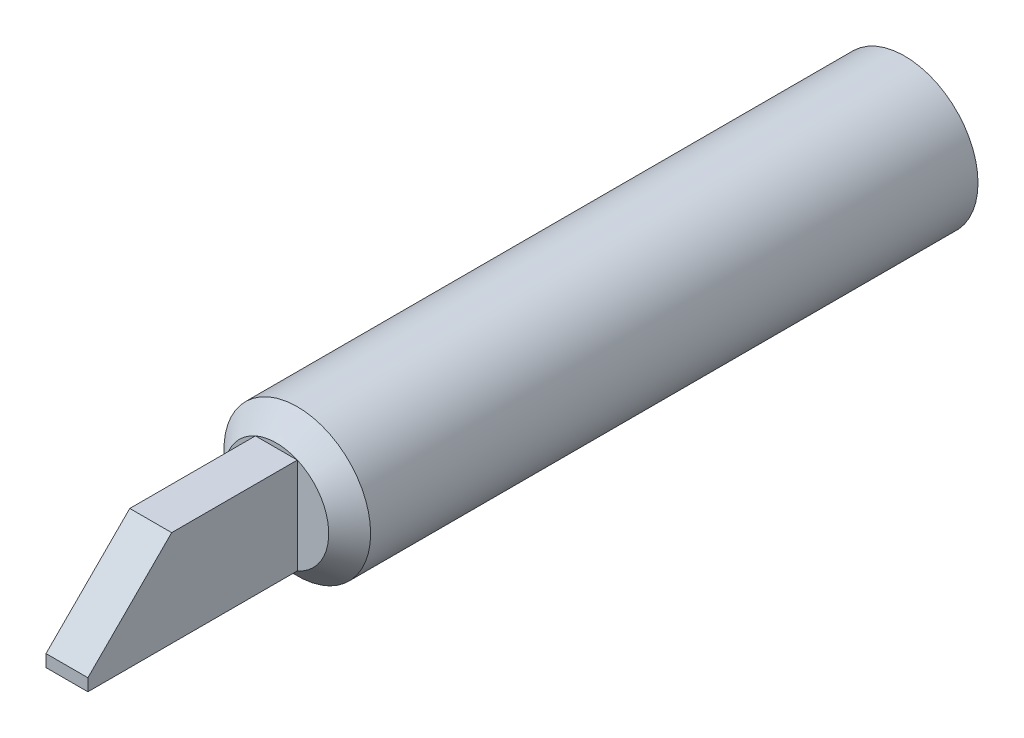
ISO-10303-21;
HEADER;
FILE_DESCRIPTION(('STEP AP214'),'2;1');
FILE_NAME('part.step','',(''),(''),'','','');
FILE_SCHEMA(('AUTOMOTIVE_DESIGN { 1 0 10303 214 1 1 1 1 }'));
ENDSEC;
DATA;
#1=APPLICATION_CONTEXT('core data for automotive mechanical design processes');
#2=APPLICATION_PROTOCOL_DEFINITION('international standard','automotive_design',2000,#1);
#3=PRODUCT_CONTEXT('',#1,'mechanical');
#4=PRODUCT('Part','Part','',(#3));
#5=PRODUCT_RELATED_PRODUCT_CATEGORY('part','',(#4));
#6=PRODUCT_DEFINITION_FORMATION('','',#4);
#7=PRODUCT_DEFINITION_CONTEXT('part definition',#1,'design');
#8=PRODUCT_DEFINITION('design','',#6,#7);
#9=PRODUCT_DEFINITION_SHAPE('','',#8);
#10=(LENGTH_UNIT() NAMED_UNIT(*) SI_UNIT(.MILLI.,.METRE.));
#11=(NAMED_UNIT(*) PLANE_ANGLE_UNIT() SI_UNIT($,.RADIAN.));
#12=(NAMED_UNIT(*) SI_UNIT($,.STERADIAN.) SOLID_ANGLE_UNIT());
#13=UNCERTAINTY_MEASURE_WITH_UNIT(LENGTH_MEASURE(1.E-05),#10,'distance_accuracy_value','');
#14=(GEOMETRIC_REPRESENTATION_CONTEXT(3) GLOBAL_UNCERTAINTY_ASSIGNED_CONTEXT((#13)) GLOBAL_UNIT_ASSIGNED_CONTEXT((#10,
#11,#12)) REPRESENTATION_CONTEXT('',''));
#15=CARTESIAN_POINT('',(0.,0.,0.));
#16=DIRECTION('',(0.,0.,1.));
#17=DIRECTION('',(1.,0.,0.));
#18=AXIS2_PLACEMENT_3D('',#15,#16,#17);
#19=CARTESIAN_POINT('',(0.,0.,30.));
#20=DIRECTION('',(0.,0.,1.));
#21=DIRECTION('',(1.,0.,0.));
#22=AXIS2_PLACEMENT_3D('',#19,#20,#21);
#23=PLANE('',#22);
#24=DIRECTION('',(0.,-1.,0.));
#25=VECTOR('',#24,1.);
#26=CARTESIAN_POINT('',(-1.,2.2912878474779,30.));
#27=LINE('',#26,#25);
#28=CARTESIAN_POINT('',(-1.,2.2912878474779,30.));
#29=VERTEX_POINT('',#28);
#30=CARTESIAN_POINT('',(-1.,-2.2912878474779,30.));
#31=VERTEX_POINT('',#30);
#32=EDGE_CURVE('E100',#29,#31,#27,.T.);
#33=ORIENTED_EDGE('',*,*,#32,.F.);
#34=CARTESIAN_POINT('',(0.,0.,30.));
#35=DIRECTION('',(0.,0.,1.));
#36=DIRECTION('',(1.,0.,0.));
#37=AXIS2_PLACEMENT_3D('',#34,#35,#36);
#38=CIRCLE('',#37,2.49999999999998);
#39=EDGE_CURVE('E114',#29,#31,#38,.T.);
#40=ORIENTED_EDGE('',*,*,#39,.T.);
#41=EDGE_LOOP('',(#33,#40));
#42=FACE_BOUND('',#41,.T.);
#43=ADVANCED_FACE('F32',(#42),#23,.T.);
#44=DIRECTION('',(-1.,0.,0.));
#45=VECTOR('',#44,1.);
#46=CARTESIAN_POINT('',(-1.,2.2912878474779,30.));
#47=LINE('',#46,#45);
#48=CARTESIAN_POINT('',(1.,2.2912878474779,30.));
#49=VERTEX_POINT('',#48);
#50=EDGE_CURVE('E85',#49,#29,#47,.T.);
#51=ORIENTED_EDGE('',*,*,#50,.F.);
#52=EDGE_CURVE('E110',#49,#29,#38,.T.);
#53=ORIENTED_EDGE('',*,*,#52,.T.);
#54=EDGE_LOOP('',(#51,#53));
#55=FACE_BOUND('',#54,.T.);
#56=ADVANCED_FACE('F151',(#55),#23,.T.);
#57=DIRECTION('',(0.,1.,0.));
#58=VECTOR('',#57,1.);
#59=CARTESIAN_POINT('',(1.,2.2912878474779,30.));
#60=LINE('',#59,#58);
#61=CARTESIAN_POINT('',(1.,-2.2912878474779,30.));
#62=VERTEX_POINT('',#61);
#63=EDGE_CURVE('E139',#62,#49,#60,.T.);
#64=ORIENTED_EDGE('',*,*,#63,.F.);
#65=EDGE_CURVE('E104',#62,#49,#38,.T.);
#66=ORIENTED_EDGE('',*,*,#65,.T.);
#67=EDGE_LOOP('',(#64,#66));
#68=FACE_BOUND('',#67,.T.);
#69=ADVANCED_FACE('F152',(#68),#23,.T.);
#70=CARTESIAN_POINT('',(0.,0.,30.));
#71=DIRECTION('',(0.,0.,-1.));
#72=DIRECTION('',(-1.,0.,0.));
#73=AXIS2_PLACEMENT_3D('',#70,#71,#72);
#74=CYLINDRICAL_SURFACE('',#73,3.5);
#75=CARTESIAN_POINT('',(0.,0.,29.));
#76=DIRECTION('',(0.,0.,1.));
#77=DIRECTION('',(1.,0.,0.));
#78=AXIS2_PLACEMENT_3D('',#75,#76,#77);
#79=CIRCLE('',#78,3.5);
#80=CARTESIAN_POINT('',(3.5,0.,29.));
#81=VERTEX_POINT('',#80);
#82=EDGE_CURVE('E113',#81,#81,#79,.F.);
#83=ORIENTED_EDGE('',*,*,#82,.T.);
#84=EDGE_LOOP('',(#83));
#85=FACE_BOUND('',#84,.T.);
#86=CARTESIAN_POINT('',(0.,0.,0.));
#87=DIRECTION('',(0.,0.,1.));
#88=DIRECTION('',(1.,0.,0.));
#89=AXIS2_PLACEMENT_3D('',#86,#87,#88);
#90=CIRCLE('',#89,3.5);
#91=CARTESIAN_POINT('',(3.5,0.,0.));
#92=VERTEX_POINT('',#91);
#93=EDGE_CURVE('E101',#92,#92,#90,.T.);
#94=ORIENTED_EDGE('',*,*,#93,.T.);
#95=EDGE_LOOP('',(#94));
#96=FACE_BOUND('',#95,.T.);
#97=ADVANCED_FACE('F120',(#85,#96),#74,.T.);
#98=DIRECTION('',(1.,0.,0.));
#99=VECTOR('',#98,1.);
#100=CARTESIAN_POINT('',(-1.,-2.2912878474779,30.));
#101=LINE('',#100,#99);
#102=EDGE_CURVE('E143',#31,#62,#101,.T.);
#103=ORIENTED_EDGE('',*,*,#102,.F.);
#104=EDGE_CURVE('E153',#31,#62,#38,.T.);
#105=ORIENTED_EDGE('',*,*,#104,.T.);
#106=EDGE_LOOP('',(#103,#105));
#107=FACE_BOUND('',#106,.T.);
#108=ADVANCED_FACE('F165',(#107),#23,.T.);
#109=CARTESIAN_POINT('',(0.,0.,0.));
#110=DIRECTION('',(0.,0.,1.));
#111=DIRECTION('',(1.,0.,0.));
#112=AXIS2_PLACEMENT_3D('',#109,#110,#111);
#113=PLANE('',#112);
#114=ORIENTED_EDGE('',*,*,#93,.F.);
#115=EDGE_LOOP('',(#114));
#116=FACE_BOUND('',#115,.T.);
#117=ADVANCED_FACE('F126',(#116),#113,.F.);
#118=CARTESIAN_POINT('',(0.,0.,30.));
#119=DIRECTION('',(0.,0.,-1.));
#120=DIRECTION('',(-1.,0.,0.));
#121=AXIS2_PLACEMENT_3D('',#118,#119,#120);
#122=CONICAL_SURFACE('',#121,2.49999999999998,0.785398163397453);
#123=ORIENTED_EDGE('',*,*,#82,.F.);
#124=EDGE_LOOP('',(#123));
#125=FACE_BOUND('',#124,.T.);
#126=ORIENTED_EDGE('',*,*,#52,.F.);
#127=ORIENTED_EDGE('',*,*,#65,.F.);
#128=ORIENTED_EDGE('',*,*,#104,.F.);
#129=ORIENTED_EDGE('',*,*,#39,.F.);
#130=EDGE_LOOP('',(#126,#127,#128,#129));
#131=FACE_BOUND('',#130,.T.);
#132=ADVANCED_FACE('F123',(#125,#131),#122,.T.);
#133=CARTESIAN_POINT('',(-1.,2.2912878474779,40.));
#134=DIRECTION('',(1.,0.,0.));
#135=DIRECTION('',(0.,0.,-1.));
#136=AXIS2_PLACEMENT_3D('',#133,#134,#135);
#137=PLANE('',#136);
#138=DIRECTION('',(0.,-1.,0.));
#139=VECTOR('',#138,1.);
#140=CARTESIAN_POINT('',(-1.,2.2912878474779,40.));
#141=LINE('',#140,#139);
#142=CARTESIAN_POINT('',(-1.,-1.7087121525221,40.));
#143=VERTEX_POINT('',#142);
#144=CARTESIAN_POINT('',(-1.,-2.2912878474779,40.));
#145=VERTEX_POINT('',#144);
#146=EDGE_CURVE('E76',#143,#145,#141,.T.);
#147=ORIENTED_EDGE('',*,*,#146,.F.);
#148=DIRECTION('',(0.,0.707106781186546,-0.707106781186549));
#149=VECTOR('',#148,1.);
#150=CARTESIAN_POINT('',(-1.,-1.7087121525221,40.));
#151=LINE('',#150,#149);
#152=CARTESIAN_POINT('',(-1.,2.2912878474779,36.));
#153=VERTEX_POINT('',#152);
#154=EDGE_CURVE('E54',#143,#153,#151,.T.);
#155=ORIENTED_EDGE('',*,*,#154,.T.);
#156=DIRECTION('',(0.,0.,-1.));
#157=VECTOR('',#156,1.);
#158=CARTESIAN_POINT('',(-1.,2.2912878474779,40.));
#159=LINE('',#158,#157);
#160=EDGE_CURVE('E149',#153,#29,#159,.T.);
#161=ORIENTED_EDGE('',*,*,#160,.T.);
#162=ORIENTED_EDGE('',*,*,#32,.T.);
#163=DIRECTION('',(0.,0.,-1.));
#164=VECTOR('',#163,1.);
#165=CARTESIAN_POINT('',(-1.,-2.2912878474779,40.));
#166=LINE('',#165,#164);
#167=EDGE_CURVE('E91',#145,#31,#166,.T.);
#168=ORIENTED_EDGE('',*,*,#167,.F.);
#169=EDGE_LOOP('',(#147,#155,#161,#162,#168));
#170=FACE_BOUND('',#169,.T.);
#171=ADVANCED_FACE('F98',(#170),#137,.F.);
#172=CARTESIAN_POINT('',(-1.,-2.2912878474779,40.));
#173=DIRECTION('',(0.,1.,0.));
#174=DIRECTION('',(0.,0.,1.));
#175=AXIS2_PLACEMENT_3D('',#172,#173,#174);
#176=PLANE('',#175);
#177=ORIENTED_EDGE('',*,*,#102,.T.);
#178=DIRECTION('',(0.,0.,-1.));
#179=VECTOR('',#178,1.);
#180=CARTESIAN_POINT('',(1.,-2.2912878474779,40.));
#181=LINE('',#180,#179);
#182=CARTESIAN_POINT('',(1.,-2.2912878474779,40.));
#183=VERTEX_POINT('',#182);
#184=EDGE_CURVE('E94',#183,#62,#181,.T.);
#185=ORIENTED_EDGE('',*,*,#184,.F.);
#186=DIRECTION('',(1.,0.,0.));
#187=VECTOR('',#186,1.);
#188=CARTESIAN_POINT('',(-1.,-2.2912878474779,40.));
#189=LINE('',#188,#187);
#190=EDGE_CURVE('E80',#145,#183,#189,.T.);
#191=ORIENTED_EDGE('',*,*,#190,.F.);
#192=ORIENTED_EDGE('',*,*,#167,.T.);
#193=EDGE_LOOP('',(#177,#185,#191,#192));
#194=FACE_BOUND('',#193,.T.);
#195=ADVANCED_FACE('F90',(#194),#176,.F.);
#196=CARTESIAN_POINT('',(1.,2.2912878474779,40.));
#197=DIRECTION('',(-1.,0.,0.));
#198=DIRECTION('',(0.,0.,1.));
#199=AXIS2_PLACEMENT_3D('',#196,#197,#198);
#200=PLANE('',#199);
#201=DIRECTION('',(0.,0.,-1.));
#202=VECTOR('',#201,1.);
#203=CARTESIAN_POINT('',(1.,2.2912878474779,40.));
#204=LINE('',#203,#202);
#205=CARTESIAN_POINT('',(1.,2.2912878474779,36.));
#206=VERTEX_POINT('',#205);
#207=EDGE_CURVE('E106',#206,#49,#204,.T.);
#208=ORIENTED_EDGE('',*,*,#207,.F.);
#209=DIRECTION('',(0.,-0.707106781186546,0.707106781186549));
#210=VECTOR('',#209,1.);
#211=CARTESIAN_POINT('',(1.,-1.7087121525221,40.));
#212=LINE('',#211,#210);
#213=CARTESIAN_POINT('',(1.,-1.7087121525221,40.));
#214=VERTEX_POINT('',#213);
#215=EDGE_CURVE('E11',#206,#214,#212,.T.);
#216=ORIENTED_EDGE('',*,*,#215,.T.);
#217=DIRECTION('',(0.,1.,0.));
#218=VECTOR('',#217,1.);
#219=CARTESIAN_POINT('',(1.,2.2912878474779,40.));
#220=LINE('',#219,#218);
#221=EDGE_CURVE('E96',#183,#214,#220,.T.);
#222=ORIENTED_EDGE('',*,*,#221,.F.);
#223=ORIENTED_EDGE('',*,*,#184,.T.);
#224=ORIENTED_EDGE('',*,*,#63,.T.);
#225=EDGE_LOOP('',(#208,#216,#222,#223,#224));
#226=FACE_BOUND('',#225,.T.);
#227=ADVANCED_FACE('F140',(#226),#200,.F.);
#228=CARTESIAN_POINT('',(-1.,2.2912878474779,40.));
#229=DIRECTION('',(0.,-1.,0.));
#230=DIRECTION('',(0.,0.,-1.));
#231=AXIS2_PLACEMENT_3D('',#228,#229,#230);
#232=PLANE('',#231);
#233=ORIENTED_EDGE('',*,*,#160,.F.);
#234=DIRECTION('',(1.,0.,0.));
#235=VECTOR('',#234,1.);
#236=CARTESIAN_POINT('',(1.,2.2912878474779,36.));
#237=LINE('',#236,#235);
#238=EDGE_CURVE('E40',#153,#206,#237,.T.);
#239=ORIENTED_EDGE('',*,*,#238,.T.);
#240=ORIENTED_EDGE('',*,*,#207,.T.);
#241=ORIENTED_EDGE('',*,*,#50,.T.);
#242=EDGE_LOOP('',(#233,#239,#240,#241));
#243=FACE_BOUND('',#242,.T.);
#244=ADVANCED_FACE('F150',(#243),#232,.F.);
#245=CARTESIAN_POINT('',(-1.,-2.2912878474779,40.));
#246=DIRECTION('',(0.,0.,1.));
#247=DIRECTION('',(1.,0.,0.));
#248=AXIS2_PLACEMENT_3D('',#245,#246,#247);
#249=PLANE('',#248);
#250=ORIENTED_EDGE('',*,*,#221,.T.);
#251=DIRECTION('',(-1.,0.,0.));
#252=VECTOR('',#251,1.);
#253=CARTESIAN_POINT('',(-1.,-1.7087121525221,40.));
#254=LINE('',#253,#252);
#255=EDGE_CURVE('E83',#214,#143,#254,.T.);
#256=ORIENTED_EDGE('',*,*,#255,.T.);
#257=ORIENTED_EDGE('',*,*,#146,.T.);
#258=ORIENTED_EDGE('',*,*,#190,.T.);
#259=EDGE_LOOP('',(#250,#256,#257,#258));
#260=FACE_BOUND('',#259,.T.);
#261=ADVANCED_FACE('F79',(#260),#249,.T.);
#262=CARTESIAN_POINT('',(-1.,-1.7087121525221,40.));
#263=DIRECTION('',(0.,0.707106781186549,0.707106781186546));
#264=DIRECTION('',(0.,-0.707106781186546,0.707106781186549));
#265=AXIS2_PLACEMENT_3D('',#262,#263,#264);
#266=PLANE('',#265);
#267=ORIENTED_EDGE('',*,*,#215,.F.);
#268=ORIENTED_EDGE('',*,*,#238,.F.);
#269=ORIENTED_EDGE('',*,*,#154,.F.);
#270=ORIENTED_EDGE('',*,*,#255,.F.);
#271=EDGE_LOOP('',(#267,#268,#269,#270));
#272=FACE_BOUND('',#271,.T.);
#273=ADVANCED_FACE('F34',(#272),#266,.T.);
#274=CLOSED_SHELL('',(#43,#56,#69,#97,#108,#117,#132,#171,#195,#227,#244,#261,#273));
#275=MANIFOLD_SOLID_BREP('B2',#274);
#276=ADVANCED_BREP_SHAPE_REPRESENTATION('',(#18,#275),#14);
#277=SHAPE_DEFINITION_REPRESENTATION(#9,#276);
ENDSEC;
END-ISO-10303-21;
